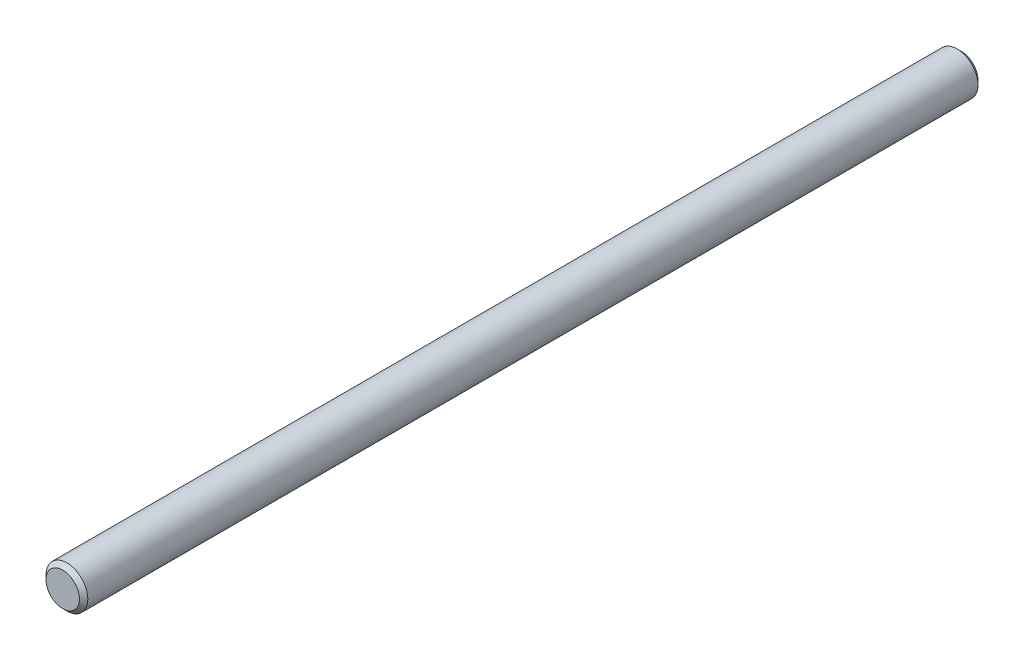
from build123d import *

# Parameters (mm, degrees)
ESQUISSE2_R     = 1
BASE_DEPTH      = 21.5
CHANFREINS_SIZE = 0.2


with BuildPart() as part:
    # Esquisse2 → Base (new, symmetric)
    with BuildSketch(Plane.XY):
        Circle(ESQUISSE2_R)
    extrude(amount=BASE_DEPTH, both=True)

    # Chanfreins
    chanfreins_edges = [part.edges().sort_by_distance(p)[0] for p in [
        (-1, 0, -21.5),
        (-1, 0, 21.5),
    ]]
    chamfer(chanfreins_edges, length=CHANFREINS_SIZE)


solid = part.part
